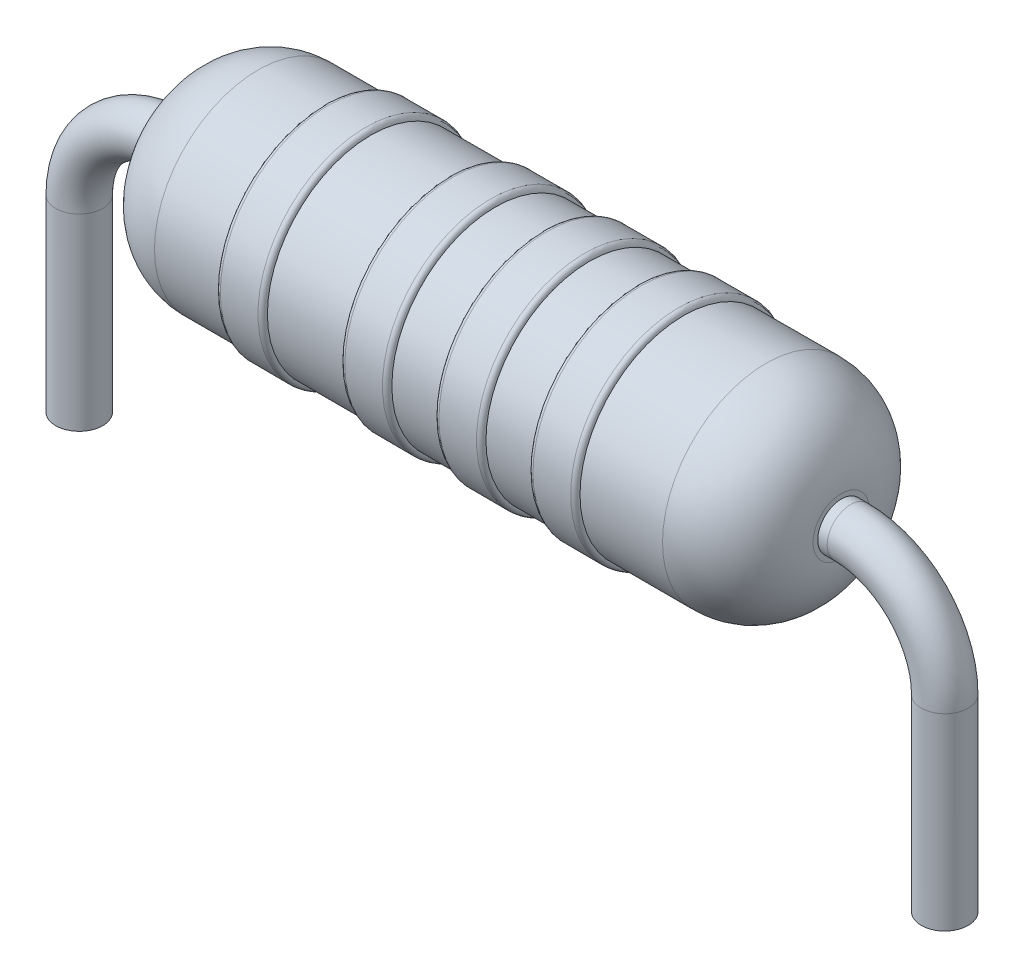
ISO-10303-21;
HEADER;
FILE_DESCRIPTION(('STEP AP214'),'2;1');
FILE_NAME('part.step','',(''),(''),'','','');
FILE_SCHEMA(('AUTOMOTIVE_DESIGN { 1 0 10303 214 1 1 1 1 }'));
ENDSEC;
DATA;
#1=APPLICATION_CONTEXT('core data for automotive mechanical design processes');
#2=APPLICATION_PROTOCOL_DEFINITION('international standard','automotive_design',2000,#1);
#3=PRODUCT_CONTEXT('',#1,'mechanical');
#4=PRODUCT('Part','Part','',(#3));
#5=PRODUCT_RELATED_PRODUCT_CATEGORY('part','',(#4));
#6=PRODUCT_DEFINITION_FORMATION('','',#4);
#7=PRODUCT_DEFINITION_CONTEXT('part definition',#1,'design');
#8=PRODUCT_DEFINITION('design','',#6,#7);
#9=PRODUCT_DEFINITION_SHAPE('','',#8);
#10=(LENGTH_UNIT() NAMED_UNIT(*) SI_UNIT(.MILLI.,.METRE.));
#11=(NAMED_UNIT(*) PLANE_ANGLE_UNIT() SI_UNIT($,.RADIAN.));
#12=(NAMED_UNIT(*) SI_UNIT($,.STERADIAN.) SOLID_ANGLE_UNIT());
#13=UNCERTAINTY_MEASURE_WITH_UNIT(LENGTH_MEASURE(1.E-05),#10,'distance_accuracy_value','');
#14=(GEOMETRIC_REPRESENTATION_CONTEXT(3) GLOBAL_UNCERTAINTY_ASSIGNED_CONTEXT((#13)) GLOBAL_UNIT_ASSIGNED_CONTEXT((#10,
#11,#12)) REPRESENTATION_CONTEXT('',''));
#15=CARTESIAN_POINT('',(0.,0.,0.));
#16=DIRECTION('',(0.,0.,1.));
#17=DIRECTION('',(1.,0.,0.));
#18=AXIS2_PLACEMENT_3D('',#15,#16,#17);
#19=CARTESIAN_POINT('',(-3.5,0.,0.));
#20=DIRECTION('',(1.,0.,0.));
#21=DIRECTION('',(0.,0.,-1.));
#22=AXIS2_PLACEMENT_3D('',#19,#20,#21);
#23=PLANE('',#22);
#24=CARTESIAN_POINT('',(-3.5,0.,0.));
#25=DIRECTION('',(-1.,0.,0.));
#26=DIRECTION('',(0.,0.,1.));
#27=AXIS2_PLACEMENT_3D('',#24,#25,#26);
#28=CIRCLE('',#27,0.299999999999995);
#29=CARTESIAN_POINT('',(-3.5,0.,0.299999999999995));
#30=VERTEX_POINT('',#29);
#31=EDGE_CURVE('E92',#30,#30,#28,.T.);
#32=ORIENTED_EDGE('',*,*,#31,.T.);
#33=EDGE_LOOP('',(#32));
#34=FACE_BOUND('',#33,.T.);
#35=CARTESIAN_POINT('',(-3.5,0.,0.));
#36=DIRECTION('',(1.,0.,0.));
#37=DIRECTION('',(0.,0.,-1.));
#38=AXIS2_PLACEMENT_3D('',#35,#36,#37);
#39=CIRCLE('',#38,0.25);
#40=CARTESIAN_POINT('',(-3.5,0.,-0.25));
#41=VERTEX_POINT('',#40);
#42=EDGE_CURVE('E10',#41,#41,#39,.F.);
#43=ORIENTED_EDGE('',*,*,#42,.F.);
#44=EDGE_LOOP('',(#43));
#45=FACE_BOUND('',#44,.T.);
#46=ADVANCED_FACE('F33',(#34,#45),#23,.F.);
#47=CARTESIAN_POINT('',(-54.2686615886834,0.,0.));
#48=DIRECTION('',(-1.,0.,0.));
#49=DIRECTION('',(0.,0.,1.));
#50=AXIS2_PLACEMENT_3D('',#47,#48,#49);
#51=CYLINDRICAL_SURFACE('',#50,1.1);
#52=CARTESIAN_POINT('',(0.322975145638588,0.,0.));
#53=DIRECTION('',(-1.,0.,0.));
#54=DIRECTION('',(0.,0.,1.));
#55=AXIS2_PLACEMENT_3D('',#52,#53,#54);
#56=CIRCLE('',#55,1.1);
#57=CARTESIAN_POINT('',(0.322975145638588,0.,1.1));
#58=VERTEX_POINT('',#57);
#59=EDGE_CURVE('E80',#58,#58,#56,.T.);
#60=ORIENTED_EDGE('',*,*,#59,.T.);
#61=EDGE_LOOP('',(#60));
#62=FACE_BOUND('',#61,.T.);
#63=CARTESIAN_POINT('',(-0.177024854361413,0.,0.));
#64=DIRECTION('',(1.,0.,0.));
#65=DIRECTION('',(0.,0.,-1.));
#66=AXIS2_PLACEMENT_3D('',#63,#64,#65);
#67=CIRCLE('',#66,1.1);
#68=CARTESIAN_POINT('',(-0.177024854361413,0.,-1.1));
#69=VERTEX_POINT('',#68);
#70=EDGE_CURVE('E89',#69,#69,#67,.T.);
#71=ORIENTED_EDGE('',*,*,#70,.T.);
#72=EDGE_LOOP('',(#71));
#73=FACE_BOUND('',#72,.T.);
#74=ADVANCED_FACE('F150',(#62,#73),#51,.T.);
#75=CARTESIAN_POINT('',(4.3261723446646,0.,0.));
#76=DIRECTION('',(1.,0.,0.));
#77=DIRECTION('',(0.,0.,-1.));
#78=AXIS2_PLACEMENT_3D('',#75,#76,#77);
#79=CYLINDRICAL_SURFACE('',#78,1.15);
#80=CARTESIAN_POINT('',(-0.627024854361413,0.,0.));
#81=DIRECTION('',(-1.,0.,0.));
#82=DIRECTION('',(0.,0.,1.));
#83=AXIS2_PLACEMENT_3D('',#80,#81,#82);
#84=CIRCLE('',#83,1.15);
#85=CARTESIAN_POINT('',(-0.627024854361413,0.,1.15));
#86=VERTEX_POINT('',#85);
#87=EDGE_CURVE('E56',#86,#86,#84,.F.);
#88=ORIENTED_EDGE('',*,*,#87,.T.);
#89=EDGE_LOOP('',(#88));
#90=FACE_BOUND('',#89,.T.);
#91=CARTESIAN_POINT('',(-0.227024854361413,0.,0.));
#92=DIRECTION('',(1.,0.,0.));
#93=DIRECTION('',(0.,0.,-1.));
#94=AXIS2_PLACEMENT_3D('',#91,#92,#93);
#95=CIRCLE('',#94,1.15);
#96=CARTESIAN_POINT('',(-0.227024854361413,0.,-1.15));
#97=VERTEX_POINT('',#96);
#98=EDGE_CURVE('E59',#97,#97,#95,.F.);
#99=ORIENTED_EDGE('',*,*,#98,.T.);
#100=EDGE_LOOP('',(#99));
#101=FACE_BOUND('',#100,.T.);
#102=ADVANCED_FACE('F156',(#90,#101),#79,.T.);
#103=CARTESIAN_POINT('',(-1.5,0.,0.));
#104=DIRECTION('',(1.,0.,0.));
#105=DIRECTION('',(0.,0.,-1.));
#106=AXIS2_PLACEMENT_3D('',#103,#104,#105);
#107=CIRCLE('',#106,1.1);
#108=CARTESIAN_POINT('',(-1.5,0.,-1.1));
#109=VERTEX_POINT('',#108);
#110=EDGE_CURVE('E73',#109,#109,#107,.T.);
#111=ORIENTED_EDGE('',*,*,#110,.T.);
#112=EDGE_LOOP('',(#111));
#113=FACE_BOUND('',#112,.T.);
#114=CARTESIAN_POINT('',(-0.677024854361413,0.,0.));
#115=DIRECTION('',(-1.,0.,0.));
#116=DIRECTION('',(0.,0.,1.));
#117=AXIS2_PLACEMENT_3D('',#114,#115,#116);
#118=CIRCLE('',#117,1.1);
#119=CARTESIAN_POINT('',(-0.677024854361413,0.,1.1));
#120=VERTEX_POINT('',#119);
#121=EDGE_CURVE('E86',#120,#120,#118,.T.);
#122=ORIENTED_EDGE('',*,*,#121,.T.);
#123=EDGE_LOOP('',(#122));
#124=FACE_BOUND('',#123,.T.);
#125=ADVANCED_FACE('F159',(#113,#124),#51,.T.);
#126=CARTESIAN_POINT('',(4.3261723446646,0.,0.));
#127=DIRECTION('',(1.,0.,0.));
#128=DIRECTION('',(0.,0.,-1.));
#129=AXIS2_PLACEMENT_3D('',#126,#127,#128);
#130=CYLINDRICAL_SURFACE('',#129,1.15);
#131=CARTESIAN_POINT('',(0.372975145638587,0.,0.));
#132=DIRECTION('',(-1.,0.,0.));
#133=DIRECTION('',(0.,0.,1.));
#134=AXIS2_PLACEMENT_3D('',#131,#132,#133);
#135=CIRCLE('',#134,1.15);
#136=CARTESIAN_POINT('',(0.372975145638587,0.,1.15));
#137=VERTEX_POINT('',#136);
#138=EDGE_CURVE('E48',#137,#137,#135,.F.);
#139=ORIENTED_EDGE('',*,*,#138,.T.);
#140=EDGE_LOOP('',(#139));
#141=FACE_BOUND('',#140,.T.);
#142=CARTESIAN_POINT('',(0.772975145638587,0.,0.));
#143=DIRECTION('',(1.,0.,0.));
#144=DIRECTION('',(0.,0.,-1.));
#145=AXIS2_PLACEMENT_3D('',#142,#143,#144);
#146=CIRCLE('',#145,1.15);
#147=CARTESIAN_POINT('',(0.772975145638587,0.,-1.15));
#148=VERTEX_POINT('',#147);
#149=EDGE_CURVE('E53',#148,#148,#146,.F.);
#150=ORIENTED_EDGE('',*,*,#149,.T.);
#151=EDGE_LOOP('',(#150));
#152=FACE_BOUND('',#151,.T.);
#153=ADVANCED_FACE('F172',(#141,#152),#130,.T.);
#154=CARTESIAN_POINT('',(1.32297514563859,0.,0.));
#155=DIRECTION('',(-1.,0.,0.));
#156=DIRECTION('',(0.,0.,1.));
#157=AXIS2_PLACEMENT_3D('',#154,#155,#156);
#158=CIRCLE('',#157,1.1);
#159=CARTESIAN_POINT('',(1.32297514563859,0.,1.1));
#160=VERTEX_POINT('',#159);
#161=EDGE_CURVE('E72',#160,#160,#158,.T.);
#162=ORIENTED_EDGE('',*,*,#161,.T.);
#163=EDGE_LOOP('',(#162));
#164=FACE_BOUND('',#163,.T.);
#165=CARTESIAN_POINT('',(0.822975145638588,0.,0.));
#166=DIRECTION('',(1.,0.,0.));
#167=DIRECTION('',(0.,0.,-1.));
#168=AXIS2_PLACEMENT_3D('',#165,#166,#167);
#169=CIRCLE('',#168,1.1);
#170=CARTESIAN_POINT('',(0.822975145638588,0.,-1.1));
#171=VERTEX_POINT('',#170);
#172=EDGE_CURVE('E83',#171,#171,#169,.T.);
#173=ORIENTED_EDGE('',*,*,#172,.T.);
#174=EDGE_LOOP('',(#173));
#175=FACE_BOUND('',#174,.T.);
#176=ADVANCED_FACE('F160',(#164,#175),#51,.T.);
#177=CARTESIAN_POINT('',(4.3261723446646,0.,0.));
#178=DIRECTION('',(1.,0.,0.));
#179=DIRECTION('',(0.,0.,-1.));
#180=AXIS2_PLACEMENT_3D('',#177,#178,#179);
#181=CYLINDRICAL_SURFACE('',#180,1.15);
#182=CARTESIAN_POINT('',(1.37297514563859,0.,0.));
#183=DIRECTION('',(-1.,0.,0.));
#184=DIRECTION('',(0.,0.,1.));
#185=AXIS2_PLACEMENT_3D('',#182,#183,#184);
#186=CIRCLE('',#185,1.15);
#187=CARTESIAN_POINT('',(1.37297514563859,0.,1.15));
#188=VERTEX_POINT('',#187);
#189=EDGE_CURVE('E40',#188,#188,#186,.F.);
#190=ORIENTED_EDGE('',*,*,#189,.T.);
#191=EDGE_LOOP('',(#190));
#192=FACE_BOUND('',#191,.T.);
#193=CARTESIAN_POINT('',(1.77297514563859,0.,0.));
#194=DIRECTION('',(1.,0.,0.));
#195=DIRECTION('',(0.,0.,-1.));
#196=AXIS2_PLACEMENT_3D('',#193,#194,#195);
#197=CIRCLE('',#196,1.15);
#198=CARTESIAN_POINT('',(1.77297514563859,0.,-1.15));
#199=VERTEX_POINT('',#198);
#200=EDGE_CURVE('E44',#199,#199,#197,.F.);
#201=ORIENTED_EDGE('',*,*,#200,.T.);
#202=EDGE_LOOP('',(#201));
#203=FACE_BOUND('',#202,.T.);
#204=ADVANCED_FACE('F182',(#192,#203),#181,.T.);
#205=CARTESIAN_POINT('',(3.5,0.299999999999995,0.));
#206=DIRECTION('',(-1.,0.,0.));
#207=DIRECTION('',(0.,0.,1.));
#208=AXIS2_PLACEMENT_3D('',#205,#206,#207);
#209=PLANE('',#208);
#210=CARTESIAN_POINT('',(3.5,0.,0.));
#211=DIRECTION('',(-1.,0.,0.));
#212=DIRECTION('',(0.,0.,1.));
#213=AXIS2_PLACEMENT_3D('',#210,#211,#212);
#214=CIRCLE('',#213,0.25);
#215=CARTESIAN_POINT('',(3.5,0.,0.25));
#216=VERTEX_POINT('',#215);
#217=EDGE_CURVE('E120',#216,#216,#214,.T.);
#218=ORIENTED_EDGE('',*,*,#217,.T.);
#219=EDGE_LOOP('',(#218));
#220=FACE_BOUND('',#219,.T.);
#221=CARTESIAN_POINT('',(3.5,0.,0.));
#222=DIRECTION('',(-1.,0.,0.));
#223=DIRECTION('',(0.,0.,1.));
#224=AXIS2_PLACEMENT_3D('',#221,#222,#223);
#225=CIRCLE('',#224,0.299999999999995);
#226=CARTESIAN_POINT('',(3.5,0.,0.299999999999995));
#227=VERTEX_POINT('',#226);
#228=EDGE_CURVE('E68',#227,#227,#225,.T.);
#229=ORIENTED_EDGE('',*,*,#228,.F.);
#230=EDGE_LOOP('',(#229));
#231=FACE_BOUND('',#230,.T.);
#232=ADVANCED_FACE('F178',(#220,#231),#209,.F.);
#233=CARTESIAN_POINT('',(2.7,0.,0.));
#234=DIRECTION('',(-1.,0.,0.));
#235=DIRECTION('',(0.,0.,1.));
#236=AXIS2_PLACEMENT_3D('',#233,#234,#235);
#237=DEGENERATE_TOROIDAL_SURFACE('',#236,0.3,0.8,.T.);
#238=CARTESIAN_POINT('',(2.69999999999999,0.,0.));
#239=DIRECTION('',(-1.,0.,0.));
#240=DIRECTION('',(0.,0.,1.));
#241=AXIS2_PLACEMENT_3D('',#238,#239,#240);
#242=CIRCLE('',#241,1.1);
#243=CARTESIAN_POINT('',(2.69999999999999,0.,1.1));
#244=VERTEX_POINT('',#243);
#245=EDGE_CURVE('E97',#244,#244,#242,.T.);
#246=ORIENTED_EDGE('',*,*,#245,.F.);
#247=EDGE_LOOP('',(#246));
#248=FACE_BOUND('',#247,.T.);
#249=ORIENTED_EDGE('',*,*,#228,.T.);
#250=EDGE_LOOP('',(#249));
#251=FACE_BOUND('',#250,.T.);
#252=ADVANCED_FACE('F174',(#248,#251),#237,.T.);
#253=CARTESIAN_POINT('',(1.82297514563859,0.,0.));
#254=DIRECTION('',(1.,0.,0.));
#255=DIRECTION('',(0.,0.,-1.));
#256=AXIS2_PLACEMENT_3D('',#253,#254,#255);
#257=CIRCLE('',#256,1.1);
#258=CARTESIAN_POINT('',(1.82297514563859,0.,-1.1));
#259=VERTEX_POINT('',#258);
#260=EDGE_CURVE('E77',#259,#259,#257,.T.);
#261=ORIENTED_EDGE('',*,*,#260,.T.);
#262=EDGE_LOOP('',(#261));
#263=FACE_BOUND('',#262,.T.);
#264=ORIENTED_EDGE('',*,*,#245,.T.);
#265=EDGE_LOOP('',(#264));
#266=FACE_BOUND('',#265,.T.);
#267=ADVANCED_FACE('F177',(#263,#266),#51,.T.);
#268=CARTESIAN_POINT('',(4.3261723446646,0.,0.));
#269=DIRECTION('',(1.,0.,0.));
#270=DIRECTION('',(0.,0.,-1.));
#271=AXIS2_PLACEMENT_3D('',#268,#269,#270);
#272=CYLINDRICAL_SURFACE('',#271,1.15);
#273=CARTESIAN_POINT('',(-1.95,0.,0.));
#274=DIRECTION('',(-1.,0.,0.));
#275=DIRECTION('',(0.,0.,1.));
#276=AXIS2_PLACEMENT_3D('',#273,#274,#275);
#277=CIRCLE('',#276,1.15);
#278=CARTESIAN_POINT('',(-1.95,0.,1.15));
#279=VERTEX_POINT('',#278);
#280=EDGE_CURVE('E62',#279,#279,#277,.F.);
#281=ORIENTED_EDGE('',*,*,#280,.T.);
#282=EDGE_LOOP('',(#281));
#283=FACE_BOUND('',#282,.T.);
#284=CARTESIAN_POINT('',(-1.55,0.,0.));
#285=DIRECTION('',(1.,0.,0.));
#286=DIRECTION('',(0.,0.,-1.));
#287=AXIS2_PLACEMENT_3D('',#284,#285,#286);
#288=CIRCLE('',#287,1.15);
#289=CARTESIAN_POINT('',(-1.55,0.,-1.15));
#290=VERTEX_POINT('',#289);
#291=EDGE_CURVE('E65',#290,#290,#288,.F.);
#292=ORIENTED_EDGE('',*,*,#291,.T.);
#293=EDGE_LOOP('',(#292));
#294=FACE_BOUND('',#293,.T.);
#295=ADVANCED_FACE('F168',(#283,#294),#272,.T.);
#296=CARTESIAN_POINT('',(-2.7,0.,0.));
#297=DIRECTION('',(-1.,0.,0.));
#298=DIRECTION('',(0.,0.,1.));
#299=AXIS2_PLACEMENT_3D('',#296,#297,#298);
#300=DEGENERATE_TOROIDAL_SURFACE('',#299,0.3,0.8,.T.);
#301=ORIENTED_EDGE('',*,*,#31,.F.);
#302=EDGE_LOOP('',(#301));
#303=FACE_BOUND('',#302,.T.);
#304=CARTESIAN_POINT('',(-2.69999999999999,0.,0.));
#305=DIRECTION('',(-1.,0.,0.));
#306=DIRECTION('',(0.,0.,1.));
#307=AXIS2_PLACEMENT_3D('',#304,#305,#306);
#308=CIRCLE('',#307,1.1);
#309=CARTESIAN_POINT('',(-2.69999999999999,0.,1.1));
#310=VERTEX_POINT('',#309);
#311=EDGE_CURVE('E100',#310,#310,#308,.T.);
#312=ORIENTED_EDGE('',*,*,#311,.T.);
#313=EDGE_LOOP('',(#312));
#314=FACE_BOUND('',#313,.T.);
#315=ADVANCED_FACE('F165',(#303,#314),#300,.T.);
#316=CARTESIAN_POINT('',(-2.,0.,0.));
#317=DIRECTION('',(-1.,0.,0.));
#318=DIRECTION('',(0.,0.,1.));
#319=AXIS2_PLACEMENT_3D('',#316,#317,#318);
#320=CIRCLE('',#319,1.1);
#321=CARTESIAN_POINT('',(-2.,0.,1.1));
#322=VERTEX_POINT('',#321);
#323=EDGE_CURVE('E69',#322,#322,#320,.T.);
#324=ORIENTED_EDGE('',*,*,#323,.T.);
#325=EDGE_LOOP('',(#324));
#326=FACE_BOUND('',#325,.T.);
#327=ORIENTED_EDGE('',*,*,#311,.F.);
#328=EDGE_LOOP('',(#327));
#329=FACE_BOUND('',#328,.T.);
#330=ADVANCED_FACE('F167',(#326,#329),#51,.T.);
#331=CARTESIAN_POINT('',(-1.95,0.,0.));
#332=DIRECTION('',(-1.,0.,0.));
#333=DIRECTION('',(0.,0.,1.));
#334=AXIS2_PLACEMENT_3D('',#331,#332,#333);
#335=TOROIDAL_SURFACE('',#334,1.1,0.05);
#336=ORIENTED_EDGE('',*,*,#323,.F.);
#337=EDGE_LOOP('',(#336));
#338=FACE_BOUND('',#337,.T.);
#339=ORIENTED_EDGE('',*,*,#280,.F.);
#340=EDGE_LOOP('',(#339));
#341=FACE_BOUND('',#340,.T.);
#342=ADVANCED_FACE('F184',(#338,#341),#335,.T.);
#343=CARTESIAN_POINT('',(-1.55,0.,0.));
#344=DIRECTION('',(1.,0.,0.));
#345=DIRECTION('',(0.,0.,-1.));
#346=AXIS2_PLACEMENT_3D('',#343,#344,#345);
#347=TOROIDAL_SURFACE('',#346,1.1,0.05);
#348=ORIENTED_EDGE('',*,*,#291,.F.);
#349=EDGE_LOOP('',(#348));
#350=FACE_BOUND('',#349,.T.);
#351=ORIENTED_EDGE('',*,*,#110,.F.);
#352=EDGE_LOOP('',(#351));
#353=FACE_BOUND('',#352,.T.);
#354=ADVANCED_FACE('F187',(#350,#353),#347,.T.);
#355=CARTESIAN_POINT('',(-0.627024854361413,0.,0.));
#356=DIRECTION('',(-1.,0.,0.));
#357=DIRECTION('',(0.,0.,1.));
#358=AXIS2_PLACEMENT_3D('',#355,#356,#357);
#359=TOROIDAL_SURFACE('',#358,1.1,0.05);
#360=ORIENTED_EDGE('',*,*,#121,.F.);
#361=EDGE_LOOP('',(#360));
#362=FACE_BOUND('',#361,.T.);
#363=ORIENTED_EDGE('',*,*,#87,.F.);
#364=EDGE_LOOP('',(#363));
#365=FACE_BOUND('',#364,.T.);
#366=ADVANCED_FACE('F191',(#362,#365),#359,.T.);
#367=CARTESIAN_POINT('',(-0.227024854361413,0.,0.));
#368=DIRECTION('',(1.,0.,0.));
#369=DIRECTION('',(0.,0.,-1.));
#370=AXIS2_PLACEMENT_3D('',#367,#368,#369);
#371=TOROIDAL_SURFACE('',#370,1.1,0.05);
#372=ORIENTED_EDGE('',*,*,#98,.F.);
#373=EDGE_LOOP('',(#372));
#374=FACE_BOUND('',#373,.T.);
#375=ORIENTED_EDGE('',*,*,#70,.F.);
#376=EDGE_LOOP('',(#375));
#377=FACE_BOUND('',#376,.T.);
#378=ADVANCED_FACE('F195',(#374,#377),#371,.T.);
#379=CARTESIAN_POINT('',(0.372975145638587,0.,0.));
#380=DIRECTION('',(-1.,0.,0.));
#381=DIRECTION('',(0.,0.,1.));
#382=AXIS2_PLACEMENT_3D('',#379,#380,#381);
#383=TOROIDAL_SURFACE('',#382,1.1,0.05);
#384=ORIENTED_EDGE('',*,*,#59,.F.);
#385=EDGE_LOOP('',(#384));
#386=FACE_BOUND('',#385,.T.);
#387=ORIENTED_EDGE('',*,*,#138,.F.);
#388=EDGE_LOOP('',(#387));
#389=FACE_BOUND('',#388,.T.);
#390=ADVANCED_FACE('F199',(#386,#389),#383,.T.);
#391=CARTESIAN_POINT('',(0.772975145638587,0.,0.));
#392=DIRECTION('',(1.,0.,0.));
#393=DIRECTION('',(0.,0.,-1.));
#394=AXIS2_PLACEMENT_3D('',#391,#392,#393);
#395=TOROIDAL_SURFACE('',#394,1.1,0.05);
#396=ORIENTED_EDGE('',*,*,#149,.F.);
#397=EDGE_LOOP('',(#396));
#398=FACE_BOUND('',#397,.T.);
#399=ORIENTED_EDGE('',*,*,#172,.F.);
#400=EDGE_LOOP('',(#399));
#401=FACE_BOUND('',#400,.T.);
#402=ADVANCED_FACE('F203',(#398,#401),#395,.T.);
#403=CARTESIAN_POINT('',(1.37297514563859,0.,0.));
#404=DIRECTION('',(-1.,0.,0.));
#405=DIRECTION('',(0.,0.,1.));
#406=AXIS2_PLACEMENT_3D('',#403,#404,#405);
#407=TOROIDAL_SURFACE('',#406,1.1,0.05);
#408=ORIENTED_EDGE('',*,*,#161,.F.);
#409=EDGE_LOOP('',(#408));
#410=FACE_BOUND('',#409,.T.);
#411=ORIENTED_EDGE('',*,*,#189,.F.);
#412=EDGE_LOOP('',(#411));
#413=FACE_BOUND('',#412,.T.);
#414=ADVANCED_FACE('F206',(#410,#413),#407,.T.);
#415=CARTESIAN_POINT('',(1.77297514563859,0.,0.));
#416=DIRECTION('',(1.,0.,0.));
#417=DIRECTION('',(0.,0.,-1.));
#418=AXIS2_PLACEMENT_3D('',#415,#416,#417);
#419=TOROIDAL_SURFACE('',#418,1.1,0.05);
#420=ORIENTED_EDGE('',*,*,#200,.F.);
#421=EDGE_LOOP('',(#420));
#422=FACE_BOUND('',#421,.T.);
#423=ORIENTED_EDGE('',*,*,#260,.F.);
#424=EDGE_LOOP('',(#423));
#425=FACE_BOUND('',#424,.T.);
#426=ADVANCED_FACE('F35',(#422,#425),#419,.T.);
#427=CARTESIAN_POINT('',(-4.6,-1.,0.));
#428=DIRECTION('',(0.,-1.,0.));
#429=DIRECTION('',(0.,0.,-1.));
#430=AXIS2_PLACEMENT_3D('',#427,#428,#429);
#431=CYLINDRICAL_SURFACE('',#430,0.25);
#432=CARTESIAN_POINT('',(-4.6,-1.,0.));
#433=DIRECTION('',(0.,-1.,0.));
#434=DIRECTION('',(0.,0.,1.));
#435=AXIS2_PLACEMENT_3D('',#432,#433,#434);
#436=CIRCLE('',#435,0.25);
#437=CARTESIAN_POINT('',(-4.85,-1.,0.));
#438=VERTEX_POINT('',#437);
#439=EDGE_CURVE('E107',#438,#438,#436,.T.);
#440=ORIENTED_EDGE('',*,*,#439,.T.);
#441=EDGE_LOOP('',(#440));
#442=FACE_BOUND('',#441,.T.);
#443=CARTESIAN_POINT('',(-4.6,-3.,0.));
#444=DIRECTION('',(0.,-1.,0.));
#445=DIRECTION('',(0.,0.,1.));
#446=AXIS2_PLACEMENT_3D('',#443,#444,#445);
#447=CIRCLE('',#446,0.25);
#448=CARTESIAN_POINT('',(-4.6,-3.,0.25));
#449=VERTEX_POINT('',#448);
#450=EDGE_CURVE('E76',#449,#449,#447,.T.);
#451=ORIENTED_EDGE('',*,*,#450,.F.);
#452=EDGE_LOOP('',(#451));
#453=FACE_BOUND('',#452,.T.);
#454=ADVANCED_FACE('F213',(#442,#453),#431,.T.);
#455=CARTESIAN_POINT('',(-3.6,-1.,0.));
#456=DIRECTION('',(0.,0.,1.));
#457=DIRECTION('',(1.,0.,0.));
#458=AXIS2_PLACEMENT_3D('',#455,#456,#457);
#459=TOROIDAL_SURFACE('',#458,1.,0.25);
#460=CARTESIAN_POINT('',(-3.6,0.,0.));
#461=DIRECTION('',(-1.,0.,0.));
#462=DIRECTION('',(0.,0.,1.));
#463=AXIS2_PLACEMENT_3D('',#460,#461,#462);
#464=CIRCLE('',#463,0.25);
#465=CARTESIAN_POINT('',(-3.6,0.25,0.));
#466=VERTEX_POINT('',#465);
#467=EDGE_CURVE('E110',#466,#466,#464,.T.);
#468=CARTESIAN_POINT('',(-3.6,-1.,0.));
#469=DIRECTION('',(0.,0.,1.));
#470=DIRECTION('',(1.,0.,0.));
#471=AXIS2_PLACEMENT_3D('',#468,#469,#470);
#472=CIRCLE('',#471,1.25);
#473=EDGE_CURVE('',#466,#438,#472,.T.);
#474=ORIENTED_EDGE('',*,*,#467,.T.);
#475=ORIENTED_EDGE('',*,*,#439,.F.);
#476=ORIENTED_EDGE('',*,*,#473,.T.);
#477=ORIENTED_EDGE('',*,*,#473,.F.);
#478=EDGE_LOOP('',(#474,#476,#475,#477));
#479=FACE_BOUND('',#478,.T.);
#480=ADVANCED_FACE('F353',(#479),#459,.T.);
#481=CARTESIAN_POINT('',(-3.6,0.,0.));
#482=DIRECTION('',(1.,0.,0.));
#483=DIRECTION('',(0.,1.,0.));
#484=AXIS2_PLACEMENT_3D('',#481,#482,#483);
#485=CYLINDRICAL_SURFACE('',#484,0.25);
#486=ORIENTED_EDGE('',*,*,#467,.F.);
#487=EDGE_LOOP('',(#486));
#488=FACE_BOUND('',#487,.T.);
#489=ORIENTED_EDGE('',*,*,#42,.T.);
#490=EDGE_LOOP('',(#489));
#491=FACE_BOUND('',#490,.T.);
#492=ADVANCED_FACE('F362',(#488,#491),#485,.T.);
#493=CARTESIAN_POINT('',(-4.6,-3.,0.));
#494=DIRECTION('',(0.,-1.,0.));
#495=DIRECTION('',(0.,0.,1.));
#496=AXIS2_PLACEMENT_3D('',#493,#494,#495);
#497=PLANE('',#496);
#498=ORIENTED_EDGE('',*,*,#450,.T.);
#499=EDGE_LOOP('',(#498));
#500=FACE_BOUND('',#499,.T.);
#501=ADVANCED_FACE('F138',(#500),#497,.T.);
#502=CARTESIAN_POINT('',(4.6,-1.,0.));
#503=DIRECTION('',(0.,-1.,0.));
#504=DIRECTION('',(0.,0.,-1.));
#505=AXIS2_PLACEMENT_3D('',#502,#503,#504);
#506=CYLINDRICAL_SURFACE('',#505,0.25);
#507=CARTESIAN_POINT('',(4.6,-1.,0.));
#508=DIRECTION('',(0.,1.,0.));
#509=DIRECTION('',(0.,0.,1.));
#510=AXIS2_PLACEMENT_3D('',#507,#508,#509);
#511=CIRCLE('',#510,0.25);
#512=CARTESIAN_POINT('',(4.85,-1.,0.));
#513=VERTEX_POINT('',#512);
#514=EDGE_CURVE('E116',#513,#513,#511,.T.);
#515=ORIENTED_EDGE('',*,*,#514,.F.);
#516=EDGE_LOOP('',(#515));
#517=FACE_BOUND('',#516,.T.);
#518=CARTESIAN_POINT('',(4.6,-3.,0.));
#519=DIRECTION('',(0.,1.,0.));
#520=DIRECTION('',(0.,0.,1.));
#521=AXIS2_PLACEMENT_3D('',#518,#519,#520);
#522=CIRCLE('',#521,0.25);
#523=CARTESIAN_POINT('',(4.6,-3.,0.25));
#524=VERTEX_POINT('',#523);
#525=EDGE_CURVE('E113',#524,#524,#522,.T.);
#526=ORIENTED_EDGE('',*,*,#525,.T.);
#527=EDGE_LOOP('',(#526));
#528=FACE_BOUND('',#527,.T.);
#529=ADVANCED_FACE('F132',(#517,#528),#506,.T.);
#530=CARTESIAN_POINT('',(3.6,-1.,0.));
#531=DIRECTION('',(0.,0.,-1.));
#532=DIRECTION('',(-1.,0.,0.));
#533=AXIS2_PLACEMENT_3D('',#530,#531,#532);
#534=TOROIDAL_SURFACE('',#533,1.,0.25);
#535=CARTESIAN_POINT('',(3.6,0.,0.));
#536=DIRECTION('',(-1.,0.,0.));
#537=DIRECTION('',(0.,0.,1.));
#538=AXIS2_PLACEMENT_3D('',#535,#536,#537);
#539=CIRCLE('',#538,0.25);
#540=CARTESIAN_POINT('',(3.6,0.25,0.));
#541=VERTEX_POINT('',#540);
#542=EDGE_CURVE('E119',#541,#541,#539,.T.);
#543=CARTESIAN_POINT('',(3.6,-1.,0.));
#544=DIRECTION('',(0.,0.,-1.));
#545=DIRECTION('',(-1.,0.,0.));
#546=AXIS2_PLACEMENT_3D('',#543,#544,#545);
#547=CIRCLE('',#546,1.25);
#548=EDGE_CURVE('',#541,#513,#547,.T.);
#549=ORIENTED_EDGE('',*,*,#542,.F.);
#550=ORIENTED_EDGE('',*,*,#514,.T.);
#551=ORIENTED_EDGE('',*,*,#548,.T.);
#552=ORIENTED_EDGE('',*,*,#548,.F.);
#553=EDGE_LOOP('',(#549,#551,#550,#552));
#554=FACE_BOUND('',#553,.T.);
#555=ADVANCED_FACE('F129',(#554),#534,.T.);
#556=CARTESIAN_POINT('',(3.6,0.,0.));
#557=DIRECTION('',(-1.,0.,0.));
#558=DIRECTION('',(0.,-1.,0.));
#559=AXIS2_PLACEMENT_3D('',#556,#557,#558);
#560=CYLINDRICAL_SURFACE('',#559,0.25);
#561=ORIENTED_EDGE('',*,*,#542,.T.);
#562=EDGE_LOOP('',(#561));
#563=FACE_BOUND('',#562,.T.);
#564=ORIENTED_EDGE('',*,*,#217,.F.);
#565=EDGE_LOOP('',(#564));
#566=FACE_BOUND('',#565,.T.);
#567=ADVANCED_FACE('F126',(#563,#566),#560,.T.);
#568=CARTESIAN_POINT('',(4.6,-3.,0.));
#569=DIRECTION('',(0.,-1.,0.));
#570=DIRECTION('',(0.,0.,1.));
#571=AXIS2_PLACEMENT_3D('',#568,#569,#570);
#572=PLANE('',#571);
#573=ORIENTED_EDGE('',*,*,#525,.F.);
#574=EDGE_LOOP('',(#573));
#575=FACE_BOUND('',#574,.T.);
#576=ADVANCED_FACE('F142',(#575),#572,.T.);
#577=CLOSED_SHELL('',(#46,#74,#102,#125,#153,#176,#204,#232,#252,#267,#295,#315,#330,#342,#354,
#366,#378,#390,#402,#414,#426,#454,#480,#492,#501,#529,#555,#567,#576));
#578=MANIFOLD_SOLID_BREP('B2',#577);
#579=ADVANCED_BREP_SHAPE_REPRESENTATION('',(#18,#578),#14);
#580=SHAPE_DEFINITION_REPRESENTATION(#9,#579);
ENDSEC;
END-ISO-10303-21;
